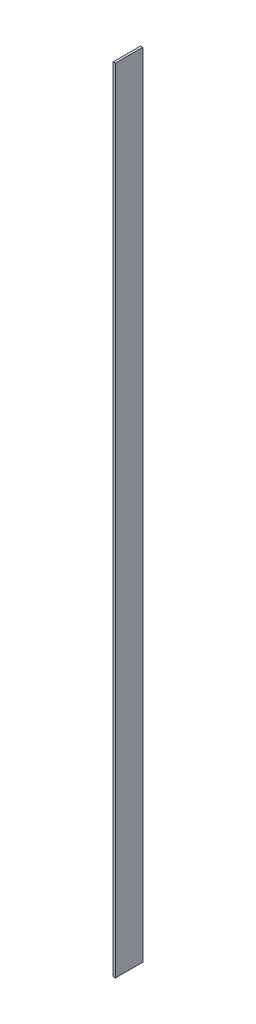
ISO-10303-21;
HEADER;
FILE_DESCRIPTION(('STEP AP214'),'2;1');
FILE_NAME('part.step','',(''),(''),'','','');
FILE_SCHEMA(('AUTOMOTIVE_DESIGN { 1 0 10303 214 1 1 1 1 }'));
ENDSEC;
DATA;
#1=APPLICATION_CONTEXT('core data for automotive mechanical design processes');
#2=APPLICATION_PROTOCOL_DEFINITION('international standard','automotive_design',2000,#1);
#3=PRODUCT_CONTEXT('',#1,'mechanical');
#4=PRODUCT('Part','Part','',(#3));
#5=PRODUCT_RELATED_PRODUCT_CATEGORY('part','',(#4));
#6=PRODUCT_DEFINITION_FORMATION('','',#4);
#7=PRODUCT_DEFINITION_CONTEXT('part definition',#1,'design');
#8=PRODUCT_DEFINITION('design','',#6,#7);
#9=PRODUCT_DEFINITION_SHAPE('','',#8);
#10=(LENGTH_UNIT() NAMED_UNIT(*) SI_UNIT(.MILLI.,.METRE.));
#11=(NAMED_UNIT(*) PLANE_ANGLE_UNIT() SI_UNIT($,.RADIAN.));
#12=(NAMED_UNIT(*) SI_UNIT($,.STERADIAN.) SOLID_ANGLE_UNIT());
#13=UNCERTAINTY_MEASURE_WITH_UNIT(LENGTH_MEASURE(1.E-05),#10,'distance_accuracy_value','');
#14=(GEOMETRIC_REPRESENTATION_CONTEXT(3) GLOBAL_UNCERTAINTY_ASSIGNED_CONTEXT((#13)) GLOBAL_UNIT_ASSIGNED_CONTEXT((#10,
#11,#12)) REPRESENTATION_CONTEXT('',''));
#15=CARTESIAN_POINT('',(0.,0.,0.));
#16=DIRECTION('',(0.,0.,1.));
#17=DIRECTION('',(1.,0.,0.));
#18=AXIS2_PLACEMENT_3D('',#15,#16,#17);
#19=CARTESIAN_POINT('',(-1.5875,-609.6,38.1));
#20=DIRECTION('',(1.,0.,0.));
#21=DIRECTION('',(0.,0.,-1.));
#22=AXIS2_PLACEMENT_3D('',#19,#20,#21);
#23=PLANE('',#22);
#24=DIRECTION('',(0.,-1.,0.));
#25=VECTOR('',#24,1.);
#26=CARTESIAN_POINT('',(-1.5875,-609.6,0.));
#27=LINE('',#26,#25);
#28=CARTESIAN_POINT('',(-1.5875,552.45,0.));
#29=VERTEX_POINT('',#28);
#30=CARTESIAN_POINT('',(-1.5875,-552.45,0.));
#31=VERTEX_POINT('',#30);
#32=EDGE_CURVE('E123',#29,#31,#27,.T.);
#33=ORIENTED_EDGE('',*,*,#32,.T.);
#34=DIRECTION('',(0.,0.,1.));
#35=VECTOR('',#34,1.);
#36=CARTESIAN_POINT('',(-1.5875,-552.45,154.126379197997));
#37=LINE('',#36,#35);
#38=CARTESIAN_POINT('',(-1.5875,-552.45,38.1));
#39=VERTEX_POINT('',#38);
#40=EDGE_CURVE('E66',#31,#39,#37,.T.);
#41=ORIENTED_EDGE('',*,*,#40,.T.);
#42=DIRECTION('',(0.,-1.,0.));
#43=VECTOR('',#42,1.);
#44=CARTESIAN_POINT('',(-1.5875,-609.6,38.1));
#45=LINE('',#44,#43);
#46=CARTESIAN_POINT('',(-1.5875,552.45,38.1));
#47=VERTEX_POINT('',#46);
#48=EDGE_CURVE('E114',#47,#39,#45,.T.);
#49=ORIENTED_EDGE('',*,*,#48,.F.);
#50=DIRECTION('',(0.,0.,-1.));
#51=VECTOR('',#50,1.);
#52=CARTESIAN_POINT('',(-1.5875,552.45,154.126379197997));
#53=LINE('',#52,#51);
#54=EDGE_CURVE('E92',#47,#29,#53,.T.);
#55=ORIENTED_EDGE('',*,*,#54,.T.);
#56=EDGE_LOOP('',(#33,#41,#49,#55));
#57=FACE_BOUND('',#56,.T.);
#58=ADVANCED_FACE('F51',(#57),#23,.F.);
#59=CARTESIAN_POINT('',(1.5875,-609.6,38.1));
#60=DIRECTION('',(-1.,0.,0.));
#61=DIRECTION('',(0.,0.,1.));
#62=AXIS2_PLACEMENT_3D('',#59,#60,#61);
#63=PLANE('',#62);
#64=DIRECTION('',(0.,1.,0.));
#65=VECTOR('',#64,1.);
#66=CARTESIAN_POINT('',(1.5875,-609.6,38.1));
#67=LINE('',#66,#65);
#68=CARTESIAN_POINT('',(1.5875,-552.45,38.1));
#69=VERTEX_POINT('',#68);
#70=CARTESIAN_POINT('',(1.5875,552.45,38.1));
#71=VERTEX_POINT('',#70);
#72=EDGE_CURVE('E105',#69,#71,#67,.T.);
#73=ORIENTED_EDGE('',*,*,#72,.F.);
#74=DIRECTION('',(0.,0.,1.));
#75=VECTOR('',#74,1.);
#76=CARTESIAN_POINT('',(1.5875,-552.45,154.126379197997));
#77=LINE('',#76,#75);
#78=CARTESIAN_POINT('',(1.5875,-552.45,0.));
#79=VERTEX_POINT('',#78);
#80=EDGE_CURVE('E109',#79,#69,#77,.T.);
#81=ORIENTED_EDGE('',*,*,#80,.F.);
#82=DIRECTION('',(0.,1.,0.));
#83=VECTOR('',#82,1.);
#84=CARTESIAN_POINT('',(1.5875,-609.6,0.));
#85=LINE('',#84,#83);
#86=CARTESIAN_POINT('',(1.5875,552.45,0.));
#87=VERTEX_POINT('',#86);
#88=EDGE_CURVE('E107',#79,#87,#85,.T.);
#89=ORIENTED_EDGE('',*,*,#88,.T.);
#90=DIRECTION('',(0.,0.,-1.));
#91=VECTOR('',#90,1.);
#92=CARTESIAN_POINT('',(1.5875,552.45,154.126379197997));
#93=LINE('',#92,#91);
#94=EDGE_CURVE('E73',#71,#87,#93,.T.);
#95=ORIENTED_EDGE('',*,*,#94,.F.);
#96=EDGE_LOOP('',(#73,#81,#89,#95));
#97=FACE_BOUND('',#96,.T.);
#98=ADVANCED_FACE('F103',(#97),#63,.F.);
#99=CARTESIAN_POINT('',(0.,0.,38.1));
#100=DIRECTION('',(0.,0.,1.));
#101=DIRECTION('',(1.,0.,0.));
#102=AXIS2_PLACEMENT_3D('',#99,#100,#101);
#103=PLANE('',#102);
#104=DIRECTION('',(-1.,0.,0.));
#105=VECTOR('',#104,1.);
#106=CARTESIAN_POINT('',(0.,-552.45,38.1));
#107=LINE('',#106,#105);
#108=EDGE_CURVE('E98',#69,#39,#107,.T.);
#109=ORIENTED_EDGE('',*,*,#108,.F.);
#110=ORIENTED_EDGE('',*,*,#72,.T.);
#111=DIRECTION('',(1.,0.,0.));
#112=VECTOR('',#111,1.);
#113=CARTESIAN_POINT('',(0.,552.45,38.1));
#114=LINE('',#113,#112);
#115=EDGE_CURVE('E89',#47,#71,#114,.T.);
#116=ORIENTED_EDGE('',*,*,#115,.F.);
#117=ORIENTED_EDGE('',*,*,#48,.T.);
#118=EDGE_LOOP('',(#109,#110,#116,#117));
#119=FACE_BOUND('',#118,.T.);
#120=ADVANCED_FACE('F112',(#119),#103,.T.);
#121=CARTESIAN_POINT('',(0.,0.,0.));
#122=DIRECTION('',(0.,0.,1.));
#123=DIRECTION('',(1.,0.,0.));
#124=AXIS2_PLACEMENT_3D('',#121,#122,#123);
#125=PLANE('',#124);
#126=ORIENTED_EDGE('',*,*,#88,.F.);
#127=DIRECTION('',(-1.,0.,0.));
#128=VECTOR('',#127,1.);
#129=CARTESIAN_POINT('',(0.,-552.45,0.));
#130=LINE('',#129,#128);
#131=EDGE_CURVE('E11',#79,#31,#130,.T.);
#132=ORIENTED_EDGE('',*,*,#131,.T.);
#133=ORIENTED_EDGE('',*,*,#32,.F.);
#134=DIRECTION('',(1.,0.,0.));
#135=VECTOR('',#134,1.);
#136=CARTESIAN_POINT('',(0.,552.45,0.));
#137=LINE('',#136,#135);
#138=EDGE_CURVE('E59',#29,#87,#137,.T.);
#139=ORIENTED_EDGE('',*,*,#138,.T.);
#140=EDGE_LOOP('',(#126,#132,#133,#139));
#141=FACE_BOUND('',#140,.T.);
#142=ADVANCED_FACE('F156',(#141),#125,.F.);
#143=CARTESIAN_POINT('',(-1.5875,552.45,154.126379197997));
#144=DIRECTION('',(0.,-1.,0.));
#145=DIRECTION('',(0.,0.,-1.));
#146=AXIS2_PLACEMENT_3D('',#143,#144,#145);
#147=PLANE('',#146);
#148=ORIENTED_EDGE('',*,*,#115,.T.);
#149=ORIENTED_EDGE('',*,*,#94,.T.);
#150=ORIENTED_EDGE('',*,*,#138,.F.);
#151=ORIENTED_EDGE('',*,*,#54,.F.);
#152=EDGE_LOOP('',(#148,#149,#150,#151));
#153=FACE_BOUND('',#152,.T.);
#154=ADVANCED_FACE('F90',(#153),#147,.F.);
#155=CARTESIAN_POINT('',(-1.5875,-552.45,154.126379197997));
#156=DIRECTION('',(0.,1.,0.));
#157=DIRECTION('',(0.,0.,1.));
#158=AXIS2_PLACEMENT_3D('',#155,#156,#157);
#159=PLANE('',#158);
#160=ORIENTED_EDGE('',*,*,#108,.T.);
#161=ORIENTED_EDGE('',*,*,#40,.F.);
#162=ORIENTED_EDGE('',*,*,#131,.F.);
#163=ORIENTED_EDGE('',*,*,#80,.T.);
#164=EDGE_LOOP('',(#160,#161,#162,#163));
#165=FACE_BOUND('',#164,.T.);
#166=ADVANCED_FACE('F157',(#165),#159,.F.);
#167=CLOSED_SHELL('',(#58,#98,#120,#142,#154,#166));
#168=MANIFOLD_SOLID_BREP('B2',#167);
#169=ADVANCED_BREP_SHAPE_REPRESENTATION('',(#18,#168),#14);
#170=SHAPE_DEFINITION_REPRESENTATION(#9,#169);
ENDSEC;
END-ISO-10303-21;
